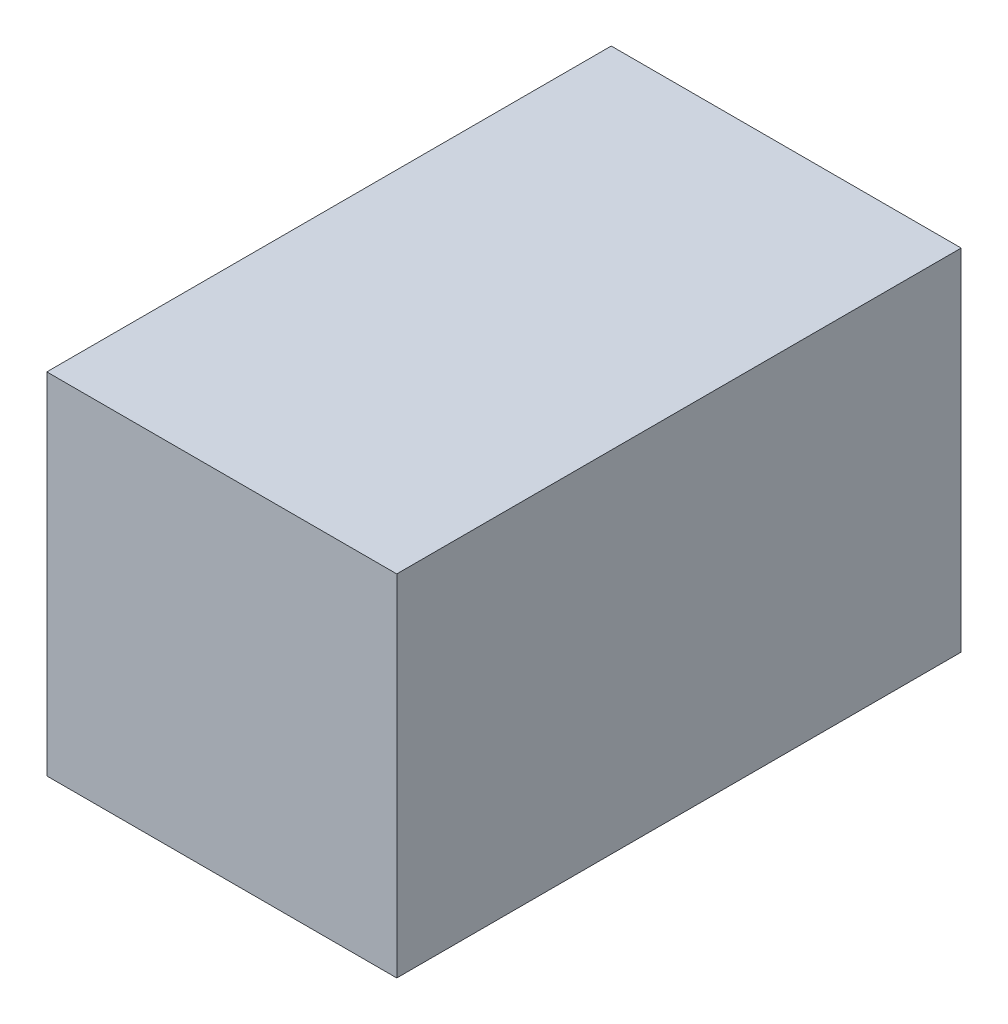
ISO-10303-21;
HEADER;
FILE_DESCRIPTION(('STEP AP214'),'2;1');
FILE_NAME('part.step','',(''),(''),'','','');
FILE_SCHEMA(('AUTOMOTIVE_DESIGN { 1 0 10303 214 1 1 1 1 }'));
ENDSEC;
DATA;
#1=APPLICATION_CONTEXT('core data for automotive mechanical design processes');
#2=APPLICATION_PROTOCOL_DEFINITION('international standard','automotive_design',2000,#1);
#3=PRODUCT_CONTEXT('',#1,'mechanical');
#4=PRODUCT('Part','Part','',(#3));
#5=PRODUCT_RELATED_PRODUCT_CATEGORY('part','',(#4));
#6=PRODUCT_DEFINITION_FORMATION('','',#4);
#7=PRODUCT_DEFINITION_CONTEXT('part definition',#1,'design');
#8=PRODUCT_DEFINITION('design','',#6,#7);
#9=PRODUCT_DEFINITION_SHAPE('','',#8);
#10=(LENGTH_UNIT() NAMED_UNIT(*) SI_UNIT(.MILLI.,.METRE.));
#11=(NAMED_UNIT(*) PLANE_ANGLE_UNIT() SI_UNIT($,.RADIAN.));
#12=(NAMED_UNIT(*) SI_UNIT($,.STERADIAN.) SOLID_ANGLE_UNIT());
#13=UNCERTAINTY_MEASURE_WITH_UNIT(LENGTH_MEASURE(1.E-05),#10,'distance_accuracy_value','');
#14=(GEOMETRIC_REPRESENTATION_CONTEXT(3) GLOBAL_UNCERTAINTY_ASSIGNED_CONTEXT((#13)) GLOBAL_UNIT_ASSIGNED_CONTEXT((#10,
#11,#12)) REPRESENTATION_CONTEXT('',''));
#15=CARTESIAN_POINT('',(0.,0.,0.));
#16=DIRECTION('',(0.,0.,1.));
#17=DIRECTION('',(1.,0.,0.));
#18=AXIS2_PLACEMENT_3D('',#15,#16,#17);
#19=CARTESIAN_POINT('',(-15.5,-15.5,-1.));
#20=DIRECTION('',(0.,-1.,0.));
#21=DIRECTION('',(0.,0.,-1.));
#22=AXIS2_PLACEMENT_3D('',#19,#20,#21);
#23=PLANE('',#22);
#24=DIRECTION('',(0.,0.,1.));
#25=VECTOR('',#24,1.);
#26=CARTESIAN_POINT('',(15.5,-15.5,-1.));
#27=LINE('',#26,#25);
#28=CARTESIAN_POINT('',(15.5,-15.5,-1.));
#29=VERTEX_POINT('',#28);
#30=CARTESIAN_POINT('',(15.5,-15.5,49.));
#31=VERTEX_POINT('',#30);
#32=EDGE_CURVE('E27',#29,#31,#27,.T.);
#33=ORIENTED_EDGE('',*,*,#32,.T.);
#34=DIRECTION('',(1.,0.,0.));
#35=VECTOR('',#34,1.);
#36=CARTESIAN_POINT('',(-15.5,-15.5,49.));
#37=LINE('',#36,#35);
#38=CARTESIAN_POINT('',(-15.5,-15.5,49.));
#39=VERTEX_POINT('',#38);
#40=EDGE_CURVE('E64',#39,#31,#37,.T.);
#41=ORIENTED_EDGE('',*,*,#40,.F.);
#42=DIRECTION('',(0.,0.,1.));
#43=VECTOR('',#42,1.);
#44=CARTESIAN_POINT('',(-15.5,-15.5,-1.));
#45=LINE('',#44,#43);
#46=CARTESIAN_POINT('',(-15.5,-15.5,-1.));
#47=VERTEX_POINT('',#46);
#48=EDGE_CURVE('E11',#47,#39,#45,.T.);
#49=ORIENTED_EDGE('',*,*,#48,.F.);
#50=DIRECTION('',(1.,0.,0.));
#51=VECTOR('',#50,1.);
#52=CARTESIAN_POINT('',(-15.5,-15.5,-1.));
#53=LINE('',#52,#51);
#54=EDGE_CURVE('E65',#47,#29,#53,.T.);
#55=ORIENTED_EDGE('',*,*,#54,.T.);
#56=EDGE_LOOP('',(#33,#41,#49,#55));
#57=FACE_BOUND('',#56,.T.);
#58=ADVANCED_FACE('F24',(#57),#23,.T.);
#59=CARTESIAN_POINT('',(-15.5,-15.5,-1.));
#60=DIRECTION('',(-1.,0.,0.));
#61=DIRECTION('',(0.,0.,1.));
#62=AXIS2_PLACEMENT_3D('',#59,#60,#61);
#63=PLANE('',#62);
#64=ORIENTED_EDGE('',*,*,#48,.T.);
#65=DIRECTION('',(0.,-1.,0.));
#66=VECTOR('',#65,1.);
#67=CARTESIAN_POINT('',(-15.5,-15.5,49.));
#68=LINE('',#67,#66);
#69=CARTESIAN_POINT('',(-15.5,15.5,49.));
#70=VERTEX_POINT('',#69);
#71=EDGE_CURVE('E81',#70,#39,#68,.T.);
#72=ORIENTED_EDGE('',*,*,#71,.F.);
#73=DIRECTION('',(0.,0.,1.));
#74=VECTOR('',#73,1.);
#75=CARTESIAN_POINT('',(-15.5,15.5,-1.));
#76=LINE('',#75,#74);
#77=CARTESIAN_POINT('',(-15.5,15.5,-1.));
#78=VERTEX_POINT('',#77);
#79=EDGE_CURVE('E32',#78,#70,#76,.T.);
#80=ORIENTED_EDGE('',*,*,#79,.F.);
#81=DIRECTION('',(0.,-1.,0.));
#82=VECTOR('',#81,1.);
#83=CARTESIAN_POINT('',(-15.5,-15.5,-1.));
#84=LINE('',#83,#82);
#85=EDGE_CURVE('E70',#78,#47,#84,.T.);
#86=ORIENTED_EDGE('',*,*,#85,.T.);
#87=EDGE_LOOP('',(#64,#72,#80,#86));
#88=FACE_BOUND('',#87,.T.);
#89=ADVANCED_FACE('F96',(#88),#63,.T.);
#90=CARTESIAN_POINT('',(-15.5,15.5,-1.));
#91=DIRECTION('',(0.,1.,0.));
#92=DIRECTION('',(0.,0.,1.));
#93=AXIS2_PLACEMENT_3D('',#90,#91,#92);
#94=PLANE('',#93);
#95=ORIENTED_EDGE('',*,*,#79,.T.);
#96=DIRECTION('',(-1.,0.,0.));
#97=VECTOR('',#96,1.);
#98=CARTESIAN_POINT('',(-15.5,15.5,49.));
#99=LINE('',#98,#97);
#100=CARTESIAN_POINT('',(15.5,15.5,49.));
#101=VERTEX_POINT('',#100);
#102=EDGE_CURVE('E77',#101,#70,#99,.T.);
#103=ORIENTED_EDGE('',*,*,#102,.F.);
#104=DIRECTION('',(0.,0.,1.));
#105=VECTOR('',#104,1.);
#106=CARTESIAN_POINT('',(15.5,15.5,-1.));
#107=LINE('',#106,#105);
#108=CARTESIAN_POINT('',(15.5,15.5,-1.));
#109=VERTEX_POINT('',#108);
#110=EDGE_CURVE('E69',#109,#101,#107,.T.);
#111=ORIENTED_EDGE('',*,*,#110,.F.);
#112=DIRECTION('',(-1.,0.,0.));
#113=VECTOR('',#112,1.);
#114=CARTESIAN_POINT('',(-15.5,15.5,-1.));
#115=LINE('',#114,#113);
#116=EDGE_CURVE('E89',#109,#78,#115,.T.);
#117=ORIENTED_EDGE('',*,*,#116,.T.);
#118=EDGE_LOOP('',(#95,#103,#111,#117));
#119=FACE_BOUND('',#118,.T.);
#120=ADVANCED_FACE('F93',(#119),#94,.T.);
#121=CARTESIAN_POINT('',(15.5,-15.5,-1.));
#122=DIRECTION('',(1.,0.,0.));
#123=DIRECTION('',(0.,0.,-1.));
#124=AXIS2_PLACEMENT_3D('',#121,#122,#123);
#125=PLANE('',#124);
#126=ORIENTED_EDGE('',*,*,#110,.T.);
#127=DIRECTION('',(0.,1.,0.));
#128=VECTOR('',#127,1.);
#129=CARTESIAN_POINT('',(15.5,-15.5,49.));
#130=LINE('',#129,#128);
#131=EDGE_CURVE('E72',#31,#101,#130,.T.);
#132=ORIENTED_EDGE('',*,*,#131,.F.);
#133=ORIENTED_EDGE('',*,*,#32,.F.);
#134=DIRECTION('',(0.,1.,0.));
#135=VECTOR('',#134,1.);
#136=CARTESIAN_POINT('',(15.5,-15.5,-1.));
#137=LINE('',#136,#135);
#138=EDGE_CURVE('E87',#29,#109,#137,.T.);
#139=ORIENTED_EDGE('',*,*,#138,.T.);
#140=EDGE_LOOP('',(#126,#132,#133,#139));
#141=FACE_BOUND('',#140,.T.);
#142=ADVANCED_FACE('F73',(#141),#125,.T.);
#143=CARTESIAN_POINT('',(15.5,-15.5,-1.));
#144=DIRECTION('',(0.,0.,1.));
#145=DIRECTION('',(1.,0.,0.));
#146=AXIS2_PLACEMENT_3D('',#143,#144,#145);
#147=PLANE('',#146);
#148=ORIENTED_EDGE('',*,*,#54,.F.);
#149=ORIENTED_EDGE('',*,*,#85,.F.);
#150=ORIENTED_EDGE('',*,*,#116,.F.);
#151=ORIENTED_EDGE('',*,*,#138,.F.);
#152=EDGE_LOOP('',(#148,#149,#150,#151));
#153=FACE_BOUND('',#152,.T.);
#154=ADVANCED_FACE('F98',(#153),#147,.F.);
#155=CARTESIAN_POINT('',(15.5,-15.5,49.));
#156=DIRECTION('',(0.,0.,1.));
#157=DIRECTION('',(1.,0.,0.));
#158=AXIS2_PLACEMENT_3D('',#155,#156,#157);
#159=PLANE('',#158);
#160=ORIENTED_EDGE('',*,*,#40,.T.);
#161=ORIENTED_EDGE('',*,*,#131,.T.);
#162=ORIENTED_EDGE('',*,*,#102,.T.);
#163=ORIENTED_EDGE('',*,*,#71,.T.);
#164=EDGE_LOOP('',(#160,#161,#162,#163));
#165=FACE_BOUND('',#164,.T.);
#166=ADVANCED_FACE('F80',(#165),#159,.T.);
#167=CLOSED_SHELL('',(#58,#89,#120,#142,#154,#166));
#168=MANIFOLD_SOLID_BREP('B2',#167);
#169=ADVANCED_BREP_SHAPE_REPRESENTATION('',(#18,#168),#14);
#170=SHAPE_DEFINITION_REPRESENTATION(#9,#169);
ENDSEC;
END-ISO-10303-21;
